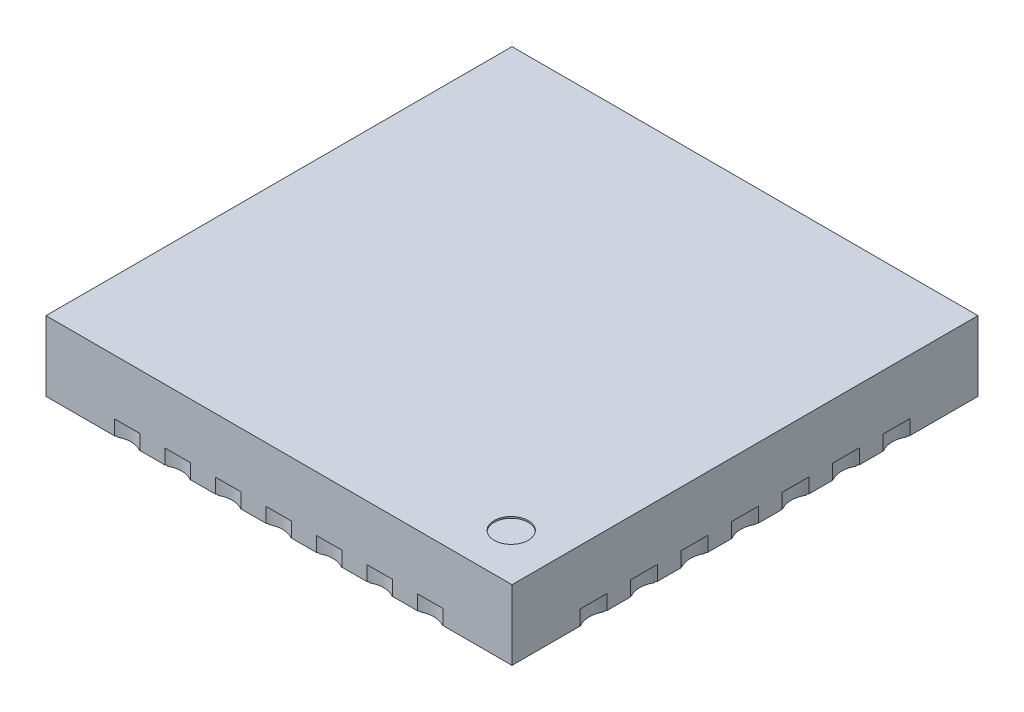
from build123d import *

# Parameters (mm, degrees)
SKETCH1_W           = 6
SKETCH1_H           = 6
BASE_EXTRUDE_DEPTH  = 0.9
SKETCH2_W           = 4.4
SKETCH2_H           = 4.4
SKETCH2_R           = 0.005
SKETCH2_W_2         = 0.5
SKETCH2_H_2         = 0.3
SKETCH2_W_3         = 0.3
SKETCH2_H_3         = 0.5
SKETCH2_W_4         = 0.4
SKETCH2_H_4         = 0.4
BOSS_EXTRUDE1_DEPTH = 0.01
SKETCH3_R           = 0.3
CUT_EXTRUDE1_DEPTH  = 0.2
SKETCH5_R           = 0.22
CUT_EXTRUDE3_DEPTH  = 0.02
SKETCH6_W           = 3
SKETCH6_H           = 3
CUT_EXTRUDE4_DEPTH  = 0.55
SKETCH7_W           = 4.4
SKETCH7_H           = 4.4
BOSS_EXTRUDE2_DEPTH = 0.3


with BuildPart() as part:
    # Sketch1 → Base-Extrude (new body)
    with BuildSketch(Plane(origin=(0, 0, 0), x_dir=(1, 0, 0), z_dir=(0, 1, 0))):
        with Locations((3, 3)):
            Rectangle(SKETCH1_W, SKETCH1_H)
    extrude(amount=BASE_EXTRUDE_DEPTH)

    # Sketch2 → Boss-Extrude1 (add)
    # profile 1 of 30: a face of its own
    with BuildSketch(Plane.XZ):
        with Locations((3.000818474, -3)):
            Rectangle(SKETCH2_W, SKETCH2_H)
        with Locations(Location((3, -3, 0), (0, 0, 270))):
            Circle(SKETCH2_R, mode=Mode.SUBTRACT)
    # profile 2 of 30: a face of its own
    with BuildSketch(Plane.XZ):
        with Locations((0.250818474, -3.65)):
            Rectangle(SKETCH2_W_2, SKETCH2_H_2)
    # profile 3 of 30: a face of its own
    with BuildSketch(Plane.XZ):
        with Locations((1.700818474, -5.75)):
            Rectangle(SKETCH2_W_3, SKETCH2_H_3)
    # profile 4 of 30: a face of its own
    with BuildSketch(Plane.XZ):
        with Locations((1.050818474, -5.75)):
            Rectangle(SKETCH2_W_3, SKETCH2_H_3)
    # profile 5 of 30: a face of its own
    with BuildSketch(Plane.XZ):
        with Locations((0.250818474, -4.95)):
            Rectangle(SKETCH2_W_2, SKETCH2_H_2)
    # profile 6 of 30: a face of its own
    with BuildSketch(Plane.XZ):
        with Locations((0.250818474, -4.3)):
            Rectangle(SKETCH2_W_2, SKETCH2_H_2)
    # profile 7 of 30: a face of its own
    with BuildSketch(Plane.XZ):
        with Locations((5.67, -0.316672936)):
            Rectangle(SKETCH2_W_4, SKETCH2_H_4)
    # profile 8 of 30: a face of its own
    with BuildSketch(Plane.XZ):
        with Locations((1.050818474, -0.25)):
            Rectangle(SKETCH2_W_3, SKETCH2_H_3)
    # profile 9 of 30: a face of its own
    with BuildSketch(Plane.XZ):
        with Locations((1.700818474, -0.25)):
            Rectangle(SKETCH2_W_3, SKETCH2_H_3)
    # profile 10 of 30: a face of its own
    with BuildSketch(Plane.XZ):
        with Locations((0.250818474, -1.05)):
            Rectangle(SKETCH2_W_2, SKETCH2_H_2)
    # profile 11 of 30: a face of its own
    with BuildSketch(Plane.XZ):
        with Locations((0.250818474, -1.7)):
            Rectangle(SKETCH2_W_2, SKETCH2_H_2)
    # profile 12 of 30: a face of its own
    with BuildSketch(Plane.XZ):
        with Locations((0.250818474, -2.35)):
            Rectangle(SKETCH2_W_2, SKETCH2_H_2)
    # profile 13 of 30: a face of its own
    with BuildSketch(Plane.XZ):
        with Locations((0.250818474, -3)):
            Rectangle(SKETCH2_W_2, SKETCH2_H_2)
    # profile 14 of 30: a face of its own
    with BuildSketch(Plane.XZ):
        with Locations((5.750818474, -3.65)):
            Rectangle(SKETCH2_W_2, SKETCH2_H_2)
    # profile 15 of 30: a face of its own
    with BuildSketch(Plane.XZ):
        with Locations((5.750818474, -4.3)):
            Rectangle(SKETCH2_W_2, SKETCH2_H_2)
    # profile 16 of 30: a face of its own
    with BuildSketch(Plane.XZ):
        with Locations((5.750818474, -4.95)):
            Rectangle(SKETCH2_W_2, SKETCH2_H_2)
    # profile 17 of 30: a face of its own
    with BuildSketch(Plane.XZ):
        with Locations((3.650818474, -5.75)):
            Rectangle(SKETCH2_W_3, SKETCH2_H_3)
    # profile 18 of 30: a face of its own
    with BuildSketch(Plane.XZ):
        with Locations((4.300818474, -5.75)):
            Rectangle(SKETCH2_W_3, SKETCH2_H_3)
    # profile 19 of 30: a face of its own
    with BuildSketch(Plane.XZ):
        with Locations((4.950818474, -5.75)):
            Rectangle(SKETCH2_W_3, SKETCH2_H_3)
    # profile 20 of 30: a face of its own
    with BuildSketch(Plane.XZ):
        with Locations((3.000818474, -5.75)):
            Rectangle(SKETCH2_W_3, SKETCH2_H_3)
    # profile 21 of 30: a face of its own
    with BuildSketch(Plane.XZ):
        with Locations((2.350818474, -5.75)):
            Rectangle(SKETCH2_W_3, SKETCH2_H_3)
    # profile 22 of 30: a face of its own
    with BuildSketch(Plane.XZ):
        with Locations((5.750818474, -1.05)):
            Rectangle(SKETCH2_W_2, SKETCH2_H_2)
    # profile 23 of 30: a face of its own
    with BuildSketch(Plane.XZ):
        with Locations((5.750818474, -3)):
            Rectangle(SKETCH2_W_2, SKETCH2_H_2)
    # profile 24 of 30: a face of its own
    with BuildSketch(Plane.XZ):
        with Locations((5.750818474, -2.35)):
            Rectangle(SKETCH2_W_2, SKETCH2_H_2)
    # profile 25 of 30: a face of its own
    with BuildSketch(Plane.XZ):
        with Locations((5.750818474, -1.7)):
            Rectangle(SKETCH2_W_2, SKETCH2_H_2)
    # profile 26 of 30: a face of its own
    with BuildSketch(Plane.XZ):
        with Locations((2.350818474, -0.25)):
            Rectangle(SKETCH2_W_3, SKETCH2_H_3)
    # profile 27 of 30: a face of its own
    with BuildSketch(Plane.XZ):
        with Locations((4.950818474, -0.25)):
            Rectangle(SKETCH2_W_3, SKETCH2_H_3)
    # profile 28 of 30: a face of its own
    with BuildSketch(Plane.XZ):
        with Locations((4.300818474, -0.25)):
            Rectangle(SKETCH2_W_3, SKETCH2_H_3)
    # profile 29 of 30: a face of its own
    with BuildSketch(Plane.XZ):
        with Locations((3.650818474, -0.25)):
            Rectangle(SKETCH2_W_3, SKETCH2_H_3)
    # profile 30 of 30: a face of its own
    with BuildSketch(Plane.XZ):
        with Locations((3.000818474, -0.25)):
            Rectangle(SKETCH2_W_3, SKETCH2_H_3)
    extrude(amount=BOSS_EXTRUDE1_DEPTH)

    # Sketch3 → Cut-Extrude1 (cut)
    with BuildSketch(Plane.XZ.offset(0.01)):
        with Locations((4.945893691, 0.25)):
            Circle(SKETCH3_R)
        with Locations((4.295893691, 0.25)):
            Circle(SKETCH3_R)
        with Locations((3.645893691, 0.25)):
            Circle(SKETCH3_R)
        with Locations((2.995893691, 0.25)):
            Circle(SKETCH3_R)
        with Locations((2.345893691, 0.25)):
            Circle(SKETCH3_R)
        with Locations((1.695893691, 0.25)):
            Circle(SKETCH3_R)
        with Locations((1.045893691, 0.25)):
            Circle(SKETCH3_R)
        with Locations((4.945893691, -6.25)):
            Circle(SKETCH3_R)
        with Locations((4.295893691, -6.25)):
            Circle(SKETCH3_R)
        with Locations((3.645893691, -6.25)):
            Circle(SKETCH3_R)
        with Locations((2.995893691, -6.25)):
            Circle(SKETCH3_R)
        with Locations((2.345893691, -6.25)):
            Circle(SKETCH3_R)
        with Locations((1.695893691, -6.25)):
            Circle(SKETCH3_R)
        with Locations((1.045893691, -6.25)):
            Circle(SKETCH3_R)
        with Locations((-0.254106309, -1.05)):
            Circle(SKETCH3_R)
        with Locations((6.245893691, -1.7)):
            Circle(SKETCH3_R)
        with Locations((6.245893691, -1.05)):
            Circle(SKETCH3_R)
        with Locations((-0.254106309, -1.7)):
            Circle(SKETCH3_R)
        with Locations((6.245893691, -2.35)):
            Circle(SKETCH3_R)
        with Locations((-0.254106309, -2.35)):
            Circle(SKETCH3_R)
        with Locations((6.245893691, -3)):
            Circle(SKETCH3_R)
        with Locations((-0.254106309, -3)):
            Circle(SKETCH3_R)
        with Locations((6.245893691, -3.65)):
            Circle(SKETCH3_R)
        with Locations((-0.254106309, -3.65)):
            Circle(SKETCH3_R)
        with Locations((6.245893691, -4.3)):
            Circle(SKETCH3_R)
        with Locations((-0.254106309, -4.3)):
            Circle(SKETCH3_R)
        with Locations((6.245893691, -4.95)):
            Circle(SKETCH3_R)
        with Locations((-0.254106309, -4.95)):
            Circle(SKETCH3_R)
    extrude(amount=-CUT_EXTRUDE1_DEPTH, mode=Mode.SUBTRACT)

    # Sketch5 → Cut-Extrude3 (cut)
    with BuildSketch(Plane(origin=(0, 0.9, 0), x_dir=(-1, 0, 0), z_dir=(0, 1, 0))):
        with Locations(Location((-5.39, -0.6, 0), (0, 0, 90))):
            Circle(SKETCH5_R)
    extrude(amount=-CUT_EXTRUDE3_DEPTH, mode=Mode.SUBTRACT)

    # Sketch6 → Cut-Extrude4 (cut)
    with BuildSketch(Plane.XZ.offset(0.01)):
        with Locations((3, -3)):
            Rectangle(SKETCH6_W, SKETCH6_H)
    extrude(amount=-CUT_EXTRUDE4_DEPTH, mode=Mode.SUBTRACT)

    # Sketch7 → Boss-Extrude2 (add)
    with BuildSketch(Plane.XZ.offset(0.01)):
        with Locations((3.000818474, -3)):
            Rectangle(SKETCH7_W, SKETCH7_H)
    extrude(amount=-BOSS_EXTRUDE2_DEPTH)


solid = part.part
